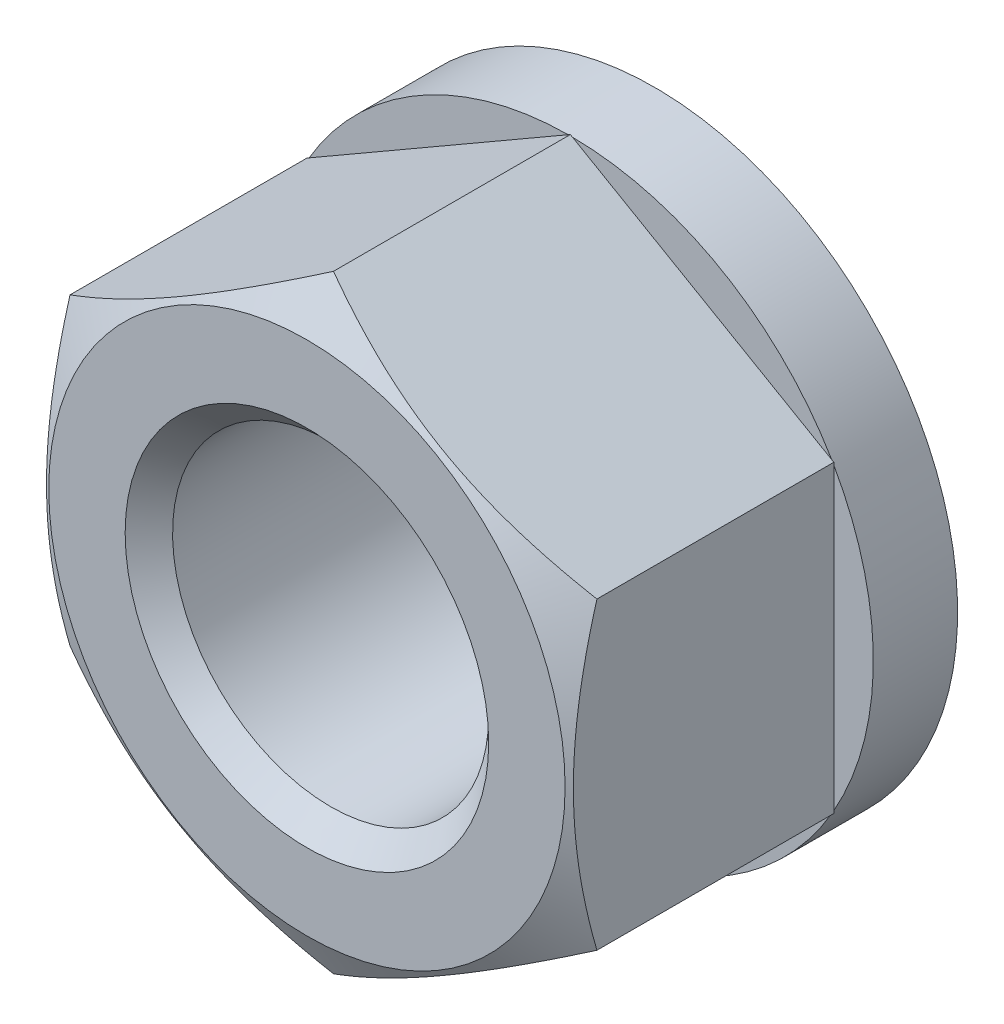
ISO-10303-21;
HEADER;
FILE_DESCRIPTION(('STEP AP214'),'2;1');
FILE_NAME('part.step','',(''),(''),'','','');
FILE_SCHEMA(('AUTOMOTIVE_DESIGN { 1 0 10303 214 1 1 1 1 }'));
ENDSEC;
DATA;
#1=APPLICATION_CONTEXT('core data for automotive mechanical design processes');
#2=APPLICATION_PROTOCOL_DEFINITION('international standard','automotive_design',2000,#1);
#3=PRODUCT_CONTEXT('',#1,'mechanical');
#4=PRODUCT('Part','Part','',(#3));
#5=PRODUCT_RELATED_PRODUCT_CATEGORY('part','',(#4));
#6=PRODUCT_DEFINITION_FORMATION('','',#4);
#7=PRODUCT_DEFINITION_CONTEXT('part definition',#1,'design');
#8=PRODUCT_DEFINITION('design','',#6,#7);
#9=PRODUCT_DEFINITION_SHAPE('','',#8);
#10=(LENGTH_UNIT() NAMED_UNIT(*) SI_UNIT(.MILLI.,.METRE.));
#11=(NAMED_UNIT(*) PLANE_ANGLE_UNIT() SI_UNIT($,.RADIAN.));
#12=(NAMED_UNIT(*) SI_UNIT($,.STERADIAN.) SOLID_ANGLE_UNIT());
#13=UNCERTAINTY_MEASURE_WITH_UNIT(LENGTH_MEASURE(1.E-05),#10,'distance_accuracy_value','');
#14=(GEOMETRIC_REPRESENTATION_CONTEXT(3) GLOBAL_UNCERTAINTY_ASSIGNED_CONTEXT((#13)) GLOBAL_UNIT_ASSIGNED_CONTEXT((#10,
#11,#12)) REPRESENTATION_CONTEXT('',''));
#15=CARTESIAN_POINT('',(0.,0.,0.));
#16=DIRECTION('',(0.,0.,1.));
#17=DIRECTION('',(1.,0.,0.));
#18=AXIS2_PLACEMENT_3D('',#15,#16,#17);
#19=CARTESIAN_POINT('',(-5.,8.66025403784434,1.6));
#20=DIRECTION('',(0.,0.,1.));
#21=DIRECTION('',(0.,1.,0.));
#22=AXIS2_PLACEMENT_3D('',#19,#20,#21);
#23=PLANE('',#22);
#24=CARTESIAN_POINT('',(0.,0.,1.6));
#25=DIRECTION('',(0.,0.,-1.));
#26=DIRECTION('',(-1.,0.,0.));
#27=AXIS2_PLACEMENT_3D('',#24,#25,#26);
#28=CIRCLE('',#27,5.75);
#29=CARTESIAN_POINT('',(-5.,2.83945417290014,1.6));
#30=VERTEX_POINT('',#29);
#31=CARTESIAN_POINT('',(-4.95903944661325,2.91039993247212,1.6));
#32=VERTEX_POINT('',#31);
#33=EDGE_CURVE('E29',#30,#32,#28,.T.);
#34=ORIENTED_EDGE('',*,*,#33,.F.);
#35=DIRECTION('',(0.,1.,0.));
#36=VECTOR('',#35,1.);
#37=CARTESIAN_POINT('',(-5.,-2.88675134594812,1.6));
#38=LINE('',#37,#36);
#39=CARTESIAN_POINT('',(-5.,2.88675134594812,1.6));
#40=VERTEX_POINT('',#39);
#41=EDGE_CURVE('E112',#30,#40,#38,.T.);
#42=ORIENTED_EDGE('',*,*,#41,.T.);
#43=DIRECTION('',(0.866025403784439,0.5,0.));
#44=VECTOR('',#43,1.);
#45=CARTESIAN_POINT('',(-5.,2.88675134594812,1.6));
#46=LINE('',#45,#44);
#47=EDGE_CURVE('E491',#40,#32,#46,.T.);
#48=ORIENTED_EDGE('',*,*,#47,.T.);
#49=EDGE_LOOP('',(#34,#42,#48));
#50=FACE_BOUND('',#49,.T.);
#51=ADVANCED_FACE('F14',(#50),#23,.F.);
#52=CARTESIAN_POINT('',(-0.0409605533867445,5.74985410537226,1.6));
#53=VERTEX_POINT('',#52);
#54=CARTESIAN_POINT('',(0.040960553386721,5.74985410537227,1.6));
#55=VERTEX_POINT('',#54);
#56=EDGE_CURVE('E142',#53,#55,#28,.T.);
#57=ORIENTED_EDGE('',*,*,#56,.F.);
#58=CARTESIAN_POINT('',(0.,5.77350269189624,1.6));
#59=VERTEX_POINT('',#58);
#60=EDGE_CURVE('E140',#53,#59,#46,.T.);
#61=ORIENTED_EDGE('',*,*,#60,.T.);
#62=DIRECTION('',(0.866025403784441,-0.5,0.));
#63=VECTOR('',#62,1.);
#64=CARTESIAN_POINT('',(0.,5.77350269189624,1.6));
#65=LINE('',#64,#63);
#66=EDGE_CURVE('E173',#59,#55,#65,.T.);
#67=ORIENTED_EDGE('',*,*,#66,.T.);
#68=EDGE_LOOP('',(#57,#61,#67));
#69=FACE_BOUND('',#68,.T.);
#70=ADVANCED_FACE('F272',(#69),#23,.F.);
#71=CARTESIAN_POINT('',(4.95903944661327,2.91039993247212,1.6));
#72=VERTEX_POINT('',#71);
#73=CARTESIAN_POINT('',(5.,2.83945417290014,1.6));
#74=VERTEX_POINT('',#73);
#75=EDGE_CURVE('E147',#72,#74,#28,.T.);
#76=ORIENTED_EDGE('',*,*,#75,.F.);
#77=CARTESIAN_POINT('',(5.,2.88675134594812,1.6));
#78=VERTEX_POINT('',#77);
#79=EDGE_CURVE('E483',#72,#78,#65,.T.);
#80=ORIENTED_EDGE('',*,*,#79,.T.);
#81=DIRECTION('',(0.,-1.,0.));
#82=VECTOR('',#81,1.);
#83=CARTESIAN_POINT('',(5.,2.88675134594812,1.6));
#84=LINE('',#83,#82);
#85=EDGE_CURVE('E175',#78,#74,#84,.T.);
#86=ORIENTED_EDGE('',*,*,#85,.T.);
#87=EDGE_LOOP('',(#76,#80,#86));
#88=FACE_BOUND('',#87,.T.);
#89=ADVANCED_FACE('F279',(#88),#23,.F.);
#90=CARTESIAN_POINT('',(5.,-2.83945417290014,1.6));
#91=VERTEX_POINT('',#90);
#92=CARTESIAN_POINT('',(4.95903944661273,-2.91039993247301,1.6));
#93=VERTEX_POINT('',#92);
#94=EDGE_CURVE('E131',#91,#93,#28,.T.);
#95=ORIENTED_EDGE('',*,*,#94,.F.);
#96=CARTESIAN_POINT('',(5.,-2.88675134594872,1.6));
#97=VERTEX_POINT('',#96);
#98=EDGE_CURVE('E160',#91,#97,#84,.T.);
#99=ORIENTED_EDGE('',*,*,#98,.T.);
#100=DIRECTION('',(-0.866025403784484,-0.499999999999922,0.));
#101=VECTOR('',#100,1.);
#102=CARTESIAN_POINT('',(5.,-2.88675134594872,1.6));
#103=LINE('',#102,#101);
#104=EDGE_CURVE('E163',#97,#93,#103,.T.);
#105=ORIENTED_EDGE('',*,*,#104,.T.);
#106=EDGE_LOOP('',(#95,#99,#105));
#107=FACE_BOUND('',#106,.T.);
#108=ADVANCED_FACE('F159',(#107),#23,.F.);
#109=CARTESIAN_POINT('',(0.0409605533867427,-5.74985410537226,1.6));
#110=VERTEX_POINT('',#109);
#111=CARTESIAN_POINT('',(-0.0409605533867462,-5.74985410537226,1.6));
#112=VERTEX_POINT('',#111);
#113=EDGE_CURVE('E129',#110,#112,#28,.T.);
#114=ORIENTED_EDGE('',*,*,#113,.F.);
#115=CARTESIAN_POINT('',(0.,-5.77350269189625,1.6));
#116=VERTEX_POINT('',#115);
#117=EDGE_CURVE('E178',#110,#116,#103,.T.);
#118=ORIENTED_EDGE('',*,*,#117,.T.);
#119=DIRECTION('',(-0.866025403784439,0.5,0.));
#120=VECTOR('',#119,1.);
#121=CARTESIAN_POINT('',(0.,-5.77350269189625,1.6));
#122=LINE('',#121,#120);
#123=EDGE_CURVE('E183',#116,#112,#122,.T.);
#124=ORIENTED_EDGE('',*,*,#123,.T.);
#125=EDGE_LOOP('',(#114,#118,#124));
#126=FACE_BOUND('',#125,.T.);
#127=ADVANCED_FACE('F293',(#126),#23,.F.);
#128=CARTESIAN_POINT('',(-4.95903944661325,-2.91039993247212,1.6));
#129=VERTEX_POINT('',#128);
#130=CARTESIAN_POINT('',(-5.,-2.83945417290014,1.6));
#131=VERTEX_POINT('',#130);
#132=EDGE_CURVE('E37',#129,#131,#28,.T.);
#133=ORIENTED_EDGE('',*,*,#132,.F.);
#134=CARTESIAN_POINT('',(-5.,-2.88675134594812,1.6));
#135=VERTEX_POINT('',#134);
#136=EDGE_CURVE('E105',#129,#135,#122,.T.);
#137=ORIENTED_EDGE('',*,*,#136,.T.);
#138=EDGE_CURVE('E102',#135,#131,#38,.T.);
#139=ORIENTED_EDGE('',*,*,#138,.T.);
#140=EDGE_LOOP('',(#133,#137,#139));
#141=FACE_BOUND('',#140,.T.);
#142=ADVANCED_FACE('F104',(#141),#23,.F.);
#143=CARTESIAN_POINT('',(-5.,-2.88675134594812,6.6));
#144=DIRECTION('',(-1.,0.,0.));
#145=DIRECTION('',(0.,0.,1.));
#146=AXIS2_PLACEMENT_3D('',#143,#144,#145);
#147=PLANE('',#146);
#148=ORIENTED_EDGE('',*,*,#138,.F.);
#149=DIRECTION('',(0.,0.,-1.));
#150=VECTOR('',#149,1.);
#151=CARTESIAN_POINT('',(-5.,-2.88675134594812,6.6));
#152=LINE('',#151,#150);
#153=CARTESIAN_POINT('',(-5.,-2.88675134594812,6.09568298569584));
#154=VERTEX_POINT('',#153);
#155=EDGE_CURVE('E130',#154,#135,#152,.T.);
#156=ORIENTED_EDGE('',*,*,#155,.F.);
#157=CARTESIAN_POINT('',(-5.,-7.69916314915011,4.12879263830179));
#158=CARTESIAN_POINT('',(-5.,-7.48123566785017,4.23428462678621));
#159=CARTESIAN_POINT('',(-5.,-7.26280196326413,4.3387490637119));
#160=CARTESIAN_POINT('',(-5.,-6.82465268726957,4.54504377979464));
#161=CARTESIAN_POINT('',(-5.,-6.60493691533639,4.64687363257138));
#162=CARTESIAN_POINT('',(-5.,-6.16279540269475,4.84784426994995));
#163=CARTESIAN_POINT('',(-5.,-5.94036138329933,4.94696690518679));
#164=CARTESIAN_POINT('',(-5.,-5.49370479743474,5.14108151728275));
#165=CARTESIAN_POINT('',(-5.,-5.26948231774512,5.23607369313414));
#166=CARTESIAN_POINT('',(-5.,-4.81186990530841,5.42371447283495));
#167=CARTESIAN_POINT('',(-5.,-4.57841191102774,5.51619801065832));
#168=CARTESIAN_POINT('',(-5.,-4.10874431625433,5.69403138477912));
#169=CARTESIAN_POINT('',(-5.,-3.87253440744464,5.77938041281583));
#170=CARTESIAN_POINT('',(-5.,-3.39744748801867,5.94066379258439));
#171=CARTESIAN_POINT('',(-5.,-3.15857718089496,6.01661768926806));
#172=CARTESIAN_POINT('',(-5.,-2.67741088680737,6.15663729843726));
#173=CARTESIAN_POINT('',(-5.,-2.43511602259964,6.22070681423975));
#174=CARTESIAN_POINT('',(-5.,-1.94829753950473,6.33350919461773));
#175=CARTESIAN_POINT('',(-5.,-1.70379306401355,6.38232313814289));
#176=CARTESIAN_POINT('',(-5.,-1.21180206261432,6.4618173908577));
#177=CARTESIAN_POINT('',(-5.,-0.964315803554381,6.49249931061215));
#178=CARTESIAN_POINT('',(-5.,-0.470806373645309,6.53287916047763));
#179=CARTESIAN_POINT('',(-5.,-0.224805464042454,6.54284247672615));
#180=CARTESIAN_POINT('',(-5.,0.267162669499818,6.54163567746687));
#181=CARTESIAN_POINT('',(-5.,0.513129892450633,6.53046503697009));
#182=CARTESIAN_POINT('',(-5.,0.932362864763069,6.49419652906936));
#183=CARTESIAN_POINT('',(-5.,1.10608264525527,6.47406050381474));
#184=CARTESIAN_POINT('',(-5.,1.45220651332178,6.42453023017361));
#185=CARTESIAN_POINT('',(-5.,1.62461041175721,6.39513467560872));
#186=CARTESIAN_POINT('',(-5.,2.13964368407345,6.29460847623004));
#187=CARTESIAN_POINT('',(-5.,2.47989285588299,6.21115802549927));
#188=CARTESIAN_POINT('',(-5.,2.98858270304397,6.06701503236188));
#189=CARTESIAN_POINT('',(-5.,3.15967426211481,6.01514963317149));
#190=CARTESIAN_POINT('',(-5.,3.50019443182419,5.90617266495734));
#191=CARTESIAN_POINT('',(-5.,3.66962303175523,5.84906106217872));
#192=CARTESIAN_POINT('',(-5.,4.00687370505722,5.7304964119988));
#193=CARTESIAN_POINT('',(-5.,4.17469631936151,5.66904488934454));
#194=CARTESIAN_POINT('',(-5.,4.50896068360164,5.54250927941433));
#195=CARTESIAN_POINT('',(-5.,4.6754024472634,5.47742522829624));
#196=CARTESIAN_POINT('',(-5.,5.05778273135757,5.32385967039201));
#197=CARTESIAN_POINT('',(-5.,5.27329135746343,5.2343099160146));
#198=CARTESIAN_POINT('',(-5.,5.70256106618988,5.05110475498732));
#199=CARTESIAN_POINT('',(-5.,5.91632205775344,4.95744913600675));
#200=CARTESIAN_POINT('',(-5.,6.34240549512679,4.7668292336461));
#201=CARTESIAN_POINT('',(-5.,6.55472767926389,4.66986436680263));
#202=CARTESIAN_POINT('',(-5.,6.9781321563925,4.47326056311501));
#203=CARTESIAN_POINT('',(-5.,7.1892144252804,4.37362157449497));
#204=CARTESIAN_POINT('',(-5.,7.82128006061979,4.07126703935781));
#205=CARTESIAN_POINT('',(-5.,8.24070087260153,3.8652867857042));
#206=CARTESIAN_POINT('',(-5.,9.07656071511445,3.44736367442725));
#207=CARTESIAN_POINT('',(-5.,9.49299964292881,3.23542061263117));
#208=CARTESIAN_POINT('',(-5.,10.099433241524,2.92283436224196));
#209=CARTESIAN_POINT('',(-5.,10.2903000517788,2.82387823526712));
#210=CARTESIAN_POINT('',(-5.,10.6716183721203,2.62517701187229));
#211=CARTESIAN_POINT('',(-5.,10.8620698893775,2.52543192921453));
#212=CARTESIAN_POINT('',(-5.,11.4328987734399,2.22516255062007));
#213=CARTESIAN_POINT('',(-5.,11.8127361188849,2.02361154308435));
#214=CARTESIAN_POINT('',(-5.,12.5704213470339,1.61887676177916));
#215=CARTESIAN_POINT('',(-5.,12.9482717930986,1.41569777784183));
#216=CARTESIAN_POINT('',(-5.,13.7030537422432,1.00768495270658));
#217=CARTESIAN_POINT('',(-5.,14.0799852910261,0.802851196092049));
#218=CARTESIAN_POINT('',(-5.,14.456575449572,0.597395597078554));
#219=B_SPLINE_CURVE_WITH_KNOTS('',3,(#157,#158,#159,#160,#161,#162,#163,#164,#165,#166,#167,
#168,#169,#170,#171,#172,#173,#174,#175,#176,#177,#178,#179,#180,#181,#182,#183,#184,#185,#186,
#187,#188,#189,#190,#191,#192,#193,#194,#195,#196,#197,#198,#199,#200,#201,#202,#203,#204,#205,
#206,#207,#208,#209,#210,#211,#212,#213,#214,#215,#216,#217,#218),.UNSPECIFIED.,.F.,.F.,(4,2,2,
2,2,2,2,2,2,2,2,2,2,2,2,2,2,2,2,2,2,2,2,2,2,2,2,2,2,2,4),(0.,0.726362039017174,1.45284090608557,
2.183368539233,2.91386093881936,3.66709851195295,4.42042130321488,5.17214959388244,
5.92363689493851,6.67105952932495,7.41841576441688,8.15613856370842,8.89387968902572,
9.41827283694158,9.94273999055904,10.9922797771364,11.5285766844,12.0648770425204,
12.600989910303,13.1370974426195,13.8371612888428,14.5372613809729,15.2374855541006,
15.9377232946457,17.339454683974,18.7412341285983,19.3862148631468,20.0311843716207,
21.3211718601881,22.6082083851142,23.8951795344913),.UNSPECIFIED.);
#220=CARTESIAN_POINT('',(-5.,2.88675134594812,6.09568298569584));
#221=VERTEX_POINT('',#220);
#222=EDGE_CURVE('E244',#154,#221,#219,.T.);
#223=ORIENTED_EDGE('',*,*,#222,.T.);
#224=DIRECTION('',(0.,0.,-1.));
#225=VECTOR('',#224,1.);
#226=CARTESIAN_POINT('',(-5.,2.88675134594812,6.6));
#227=LINE('',#226,#225);
#228=EDGE_CURVE('E497',#221,#40,#227,.T.);
#229=ORIENTED_EDGE('',*,*,#228,.T.);
#230=ORIENTED_EDGE('',*,*,#41,.F.);
#231=EDGE_CURVE('E110',#131,#30,#38,.T.);
#232=ORIENTED_EDGE('',*,*,#231,.F.);
#233=EDGE_LOOP('',(#148,#156,#223,#229,#230,#232));
#234=FACE_BOUND('',#233,.T.);
#235=ADVANCED_FACE('F115',(#234),#147,.T.);
#236=CARTESIAN_POINT('',(-5.,-2.88675134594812,6.6));
#237=DIRECTION('',(0.5,0.86602540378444,0.));
#238=DIRECTION('',(-0.86602540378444,0.5,0.));
#239=AXIS2_PLACEMENT_3D('',#236,#237,#238);
#240=PLANE('',#239);
#241=ORIENTED_EDGE('',*,*,#123,.F.);
#242=DIRECTION('',(0.,0.,-1.));
#243=VECTOR('',#242,1.);
#244=CARTESIAN_POINT('',(0.,-5.77350269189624,6.6));
#245=LINE('',#244,#243);
#246=CARTESIAN_POINT('',(0.,-5.77350269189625,6.09568298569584));
#247=VERTEX_POINT('',#246);
#248=EDGE_CURVE('E132',#247,#116,#245,.T.);
#249=ORIENTED_EDGE('',*,*,#248,.F.);
#250=CARTESIAN_POINT('',(-5.0002,-2.88663587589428,6.09561631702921));
#251=CARTESIAN_POINT('',(-4.78046540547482,-3.01349970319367,6.1688784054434));
#252=CARTESIAN_POINT('',(-4.55885141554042,-3.14144859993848,6.23551365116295));
#253=CARTESIAN_POINT('',(-4.11178600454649,-3.3995619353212,6.35182598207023));
#254=CARTESIAN_POINT('',(-3.88632664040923,-3.52973095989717,6.40146192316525));
#255=CARTESIAN_POINT('',(-3.43816769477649,-3.78847564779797,6.47871394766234));
#256=CARTESIAN_POINT('',(-3.21553790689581,-3.91701101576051,6.50684459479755));
#257=CARTESIAN_POINT('',(-2.88081009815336,-4.11026620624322,6.53207005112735));
#258=CARTESIAN_POINT('',(-2.76915780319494,-4.1747286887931,6.53765151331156));
#259=CARTESIAN_POINT('',(-2.5457500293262,-4.30371322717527,6.54306275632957));
#260=CARTESIAN_POINT('',(-2.43399455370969,-4.36823528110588,6.54289271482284));
#261=CARTESIAN_POINT('',(-2.12781576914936,-4.54500768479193,6.53451134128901));
#262=CARTESIAN_POINT('',(-1.93349391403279,-4.65719946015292,6.52043520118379));
#263=CARTESIAN_POINT('',(-1.5461398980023,-4.8808384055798,6.47579971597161));
#264=CARTESIAN_POINT('',(-1.35310909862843,-4.99228478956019,6.44522511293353));
#265=CARTESIAN_POINT('',(-0.964974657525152,-5.21637431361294,6.36879647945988));
#266=CARTESIAN_POINT('',(-0.769920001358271,-5.32898917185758,6.32261859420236));
#267=CARTESIAN_POINT('',(-0.38271965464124,-5.55253939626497,6.21781317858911));
#268=CARTESIAN_POINT('',(-0.190569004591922,-5.6634776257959,6.15921026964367));
#269=CARTESIAN_POINT('',(0.000199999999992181,-5.77361816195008,6.09561631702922));
#270=B_SPLINE_CURVE_WITH_KNOTS('',3,(#250,#251,#252,#253,#254,#255,#256,#257,#258,#259,#260,
#261,#262,#263,#264,#265,#266,#267,#268,#269),.UNSPECIFIED.,.F.,.F.,(4,2,2,2,2,2,2,2,2,4),(0.,
0.79255584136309,1.58701660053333,2.3618153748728,2.74884076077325,3.13585419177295,
3.80962362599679,4.48401723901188,5.17336882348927,5.86136694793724),.UNSPECIFIED.);
#271=EDGE_CURVE('E239',#154,#247,#270,.T.);
#272=ORIENTED_EDGE('',*,*,#271,.F.);
#273=ORIENTED_EDGE('',*,*,#155,.T.);
#274=ORIENTED_EDGE('',*,*,#136,.F.);
#275=EDGE_CURVE('E185',#112,#129,#122,.T.);
#276=ORIENTED_EDGE('',*,*,#275,.F.);
#277=EDGE_LOOP('',(#241,#249,#272,#273,#274,#276));
#278=FACE_BOUND('',#277,.T.);
#279=ADVANCED_FACE('F250',(#278),#240,.F.);
#280=CARTESIAN_POINT('',(5.,-2.88675134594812,6.6));
#281=DIRECTION('',(0.5,-0.86602540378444,0.));
#282=DIRECTION('',(0.86602540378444,0.5,0.));
#283=AXIS2_PLACEMENT_3D('',#280,#281,#282);
#284=PLANE('',#283);
#285=ORIENTED_EDGE('',*,*,#104,.F.);
#286=DIRECTION('',(0.,0.,-1.));
#287=VECTOR('',#286,1.);
#288=CARTESIAN_POINT('',(5.,-2.88675134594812,6.6));
#289=LINE('',#288,#287);
#290=CARTESIAN_POINT('',(5.,-2.88675134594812,6.09568298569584));
#291=VERTEX_POINT('',#290);
#292=EDGE_CURVE('E172',#291,#97,#289,.T.);
#293=ORIENTED_EDGE('',*,*,#292,.F.);
#294=CARTESIAN_POINT('',(5.0002,-2.88663587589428,6.09561631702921));
#295=CARTESIAN_POINT('',(4.78046540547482,-3.01349970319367,6.1688784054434));
#296=CARTESIAN_POINT('',(4.55885141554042,-3.14144859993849,6.23551365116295));
#297=CARTESIAN_POINT('',(4.11178600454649,-3.3995619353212,6.35182598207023));
#298=CARTESIAN_POINT('',(3.88632664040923,-3.52973095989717,6.40146192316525));
#299=CARTESIAN_POINT('',(3.43816769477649,-3.78847564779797,6.47871394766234));
#300=CARTESIAN_POINT('',(3.21553790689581,-3.91701101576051,6.50684459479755));
#301=CARTESIAN_POINT('',(2.88081009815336,-4.11026620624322,6.53207005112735));
#302=CARTESIAN_POINT('',(2.76915780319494,-4.1747286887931,6.53765151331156));
#303=CARTESIAN_POINT('',(2.5457500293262,-4.30371322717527,6.54306275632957));
#304=CARTESIAN_POINT('',(2.43399455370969,-4.36823528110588,6.54289271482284));
#305=CARTESIAN_POINT('',(2.12781576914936,-4.54500768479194,6.53451134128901));
#306=CARTESIAN_POINT('',(1.93349391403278,-4.65719946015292,6.52043520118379));
#307=CARTESIAN_POINT('',(1.54613989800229,-4.88083840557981,6.47579971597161));
#308=CARTESIAN_POINT('',(1.35310909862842,-4.9922847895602,6.44522511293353));
#309=CARTESIAN_POINT('',(0.964974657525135,-5.21637431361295,6.36879647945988));
#310=CARTESIAN_POINT('',(0.769920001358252,-5.32898917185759,6.32261859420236));
#311=CARTESIAN_POINT('',(0.382719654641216,-5.55253939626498,6.2178131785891));
#312=CARTESIAN_POINT('',(0.190569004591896,-5.66347762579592,6.15921026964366));
#313=CARTESIAN_POINT('',(-0.000200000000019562,-5.7736181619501,6.09561631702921));
#314=B_SPLINE_CURVE_WITH_KNOTS('',3,(#294,#295,#296,#297,#298,#299,#300,#301,#302,#303,#304,
#305,#306,#307,#308,#309,#310,#311,#312,#313),.UNSPECIFIED.,.F.,.F.,(4,2,2,2,2,2,2,2,2,4),(0.,
0.792555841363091,1.58701660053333,2.3618153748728,2.74884076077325,3.13585419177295,
3.8096236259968,4.4840172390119,5.1733688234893,5.86136694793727),.UNSPECIFIED.);
#315=EDGE_CURVE('E232',#291,#247,#314,.T.);
#316=ORIENTED_EDGE('',*,*,#315,.T.);
#317=ORIENTED_EDGE('',*,*,#248,.T.);
#318=ORIENTED_EDGE('',*,*,#117,.F.);
#319=EDGE_CURVE('E182',#93,#110,#103,.T.);
#320=ORIENTED_EDGE('',*,*,#319,.F.);
#321=EDGE_LOOP('',(#285,#293,#316,#317,#318,#320));
#322=FACE_BOUND('',#321,.T.);
#323=ADVANCED_FACE('F253',(#322),#284,.T.);
#324=CARTESIAN_POINT('',(5.,-2.88675134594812,6.6));
#325=DIRECTION('',(-1.,0.,0.));
#326=DIRECTION('',(0.,0.,1.));
#327=AXIS2_PLACEMENT_3D('',#324,#325,#326);
#328=PLANE('',#327);
#329=ORIENTED_EDGE('',*,*,#85,.F.);
#330=DIRECTION('',(0.,0.,-1.));
#331=VECTOR('',#330,1.);
#332=CARTESIAN_POINT('',(5.,2.88675134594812,6.6));
#333=LINE('',#332,#331);
#334=CARTESIAN_POINT('',(5.,2.88675134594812,6.09568298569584));
#335=VERTEX_POINT('',#334);
#336=EDGE_CURVE('E490',#335,#78,#333,.T.);
#337=ORIENTED_EDGE('',*,*,#336,.F.);
#338=CARTESIAN_POINT('',(5.,-7.69916314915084,4.12879263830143));
#339=CARTESIAN_POINT('',(5.,-7.48123566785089,4.23428462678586));
#340=CARTESIAN_POINT('',(5.,-7.26280196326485,4.33874906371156));
#341=CARTESIAN_POINT('',(5.,-6.82465268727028,4.54504377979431));
#342=CARTESIAN_POINT('',(5.,-6.60493691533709,4.64687363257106));
#343=CARTESIAN_POINT('',(5.,-6.16279540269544,4.84784426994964));
#344=CARTESIAN_POINT('',(5.,-5.94036138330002,4.94696690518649));
#345=CARTESIAN_POINT('',(5.,-5.49370479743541,5.14108151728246));
#346=CARTESIAN_POINT('',(5.,-5.26948231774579,5.23607369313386));
#347=CARTESIAN_POINT('',(5.,-4.81186990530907,5.42371447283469));
#348=CARTESIAN_POINT('',(5.,-4.57841191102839,5.51619801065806));
#349=CARTESIAN_POINT('',(5.,-4.10874431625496,5.69403138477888));
#350=CARTESIAN_POINT('',(5.,-3.87253440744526,5.77938041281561));
#351=CARTESIAN_POINT('',(5.,-3.39744748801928,5.94066379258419));
#352=CARTESIAN_POINT('',(5.,-3.15857718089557,6.01661768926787));
#353=CARTESIAN_POINT('',(5.,-2.67741088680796,6.1566372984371));
#354=CARTESIAN_POINT('',(5.,-2.43511602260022,6.22070681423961));
#355=CARTESIAN_POINT('',(5.,-1.9482975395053,6.33350919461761));
#356=CARTESIAN_POINT('',(5.,-1.70379306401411,6.38232313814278));
#357=CARTESIAN_POINT('',(5.,-1.21180206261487,6.46181739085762));
#358=CARTESIAN_POINT('',(5.,-0.964315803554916,6.49249931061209));
#359=CARTESIAN_POINT('',(5.,-0.470806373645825,6.5328791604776));
#360=CARTESIAN_POINT('',(5.,-0.224805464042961,6.54284247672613));
#361=CARTESIAN_POINT('',(5.,0.267162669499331,6.54163567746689));
#362=CARTESIAN_POINT('',(5.,0.513129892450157,6.53046503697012));
#363=CARTESIAN_POINT('',(5.,0.932362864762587,6.49419652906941));
#364=CARTESIAN_POINT('',(5.,1.10608264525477,6.4740605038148));
#365=CARTESIAN_POINT('',(5.,1.45220651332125,6.4245302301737));
#366=CARTESIAN_POINT('',(5.,1.62461041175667,6.39513467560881));
#367=CARTESIAN_POINT('',(5.,2.13964368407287,6.29460847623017));
#368=CARTESIAN_POINT('',(5.,2.47989285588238,6.21115802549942));
#369=CARTESIAN_POINT('',(5.,2.98858270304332,6.06701503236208));
#370=CARTESIAN_POINT('',(5.,3.15967426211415,6.0151496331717));
#371=CARTESIAN_POINT('',(5.,3.5001944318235,5.90617266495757));
#372=CARTESIAN_POINT('',(5.,3.66962303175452,5.84906106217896));
#373=CARTESIAN_POINT('',(5.,4.00687370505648,5.73049641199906));
#374=CARTESIAN_POINT('',(5.,4.17469631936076,5.66904488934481));
#375=CARTESIAN_POINT('',(5.,4.50896068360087,5.54250927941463));
#376=CARTESIAN_POINT('',(5.,4.67540244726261,5.47742522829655));
#377=CARTESIAN_POINT('',(5.,5.0577827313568,5.32385967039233));
#378=CARTESIAN_POINT('',(5.,5.27329135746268,5.23430991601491));
#379=CARTESIAN_POINT('',(5.,5.70256106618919,5.05110475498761));
#380=CARTESIAN_POINT('',(5.,5.91632205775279,4.95744913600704));
#381=CARTESIAN_POINT('',(5.,6.34240549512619,4.76682923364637));
#382=CARTESIAN_POINT('',(5.,6.55472767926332,4.66986436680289));
#383=CARTESIAN_POINT('',(5.,6.97813215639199,4.47326056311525));
#384=CARTESIAN_POINT('',(5.,7.18921442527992,4.3736215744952));
#385=CARTESIAN_POINT('',(5.,7.82128006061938,4.07126703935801));
#386=CARTESIAN_POINT('',(5.,8.24070087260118,3.86528678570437));
#387=CARTESIAN_POINT('',(5.,9.07656071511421,3.44736367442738));
#388=CARTESIAN_POINT('',(5.,9.49299964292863,3.23542061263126));
#389=CARTESIAN_POINT('',(5.,10.0994332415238,2.92283436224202));
#390=CARTESIAN_POINT('',(5.,10.2903000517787,2.82387823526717));
#391=CARTESIAN_POINT('',(5.,10.6716183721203,2.62517701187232));
#392=CARTESIAN_POINT('',(5.,10.8620698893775,2.52543192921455));
#393=CARTESIAN_POINT('',(5.,11.4328987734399,2.22516255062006));
#394=CARTESIAN_POINT('',(5.,11.8127361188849,2.02361154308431));
#395=CARTESIAN_POINT('',(5.,12.5704213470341,1.61887676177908));
#396=CARTESIAN_POINT('',(5.,12.9482717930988,1.41569777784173));
#397=CARTESIAN_POINT('',(5.,13.7030537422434,1.00768495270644));
#398=CARTESIAN_POINT('',(5.,14.0799852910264,0.80285119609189));
#399=CARTESIAN_POINT('',(5.,14.4565754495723,0.597395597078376));
#400=B_SPLINE_CURVE_WITH_KNOTS('',3,(#338,#339,#340,#341,#342,#343,#344,#345,#346,#347,#348,
#349,#350,#351,#352,#353,#354,#355,#356,#357,#358,#359,#360,#361,#362,#363,#364,#365,#366,#367,
#368,#369,#370,#371,#372,#373,#374,#375,#376,#377,#378,#379,#380,#381,#382,#383,#384,#385,#386,
#387,#388,#389,#390,#391,#392,#393,#394,#395,#396,#397,#398,#399),.UNSPECIFIED.,.F.,.F.,(4,2,2,
2,2,2,2,2,2,2,2,2,2,2,2,2,2,2,2,2,2,2,2,2,2,2,2,2,2,2,4),(0.,0.7263620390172,1.45284090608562,
2.18336853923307,2.91386093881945,3.66709851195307,4.42042130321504,5.17214959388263,
5.92363689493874,6.67105952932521,7.41841576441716,8.15613856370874,8.89387968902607,
9.41827283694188,9.94273999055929,10.9922797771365,11.5285766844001,12.0648770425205,
12.600989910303,13.1370974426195,13.8371612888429,14.5372613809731,15.2374855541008,
15.937723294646,17.3394546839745,18.741234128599,19.3862148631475,20.0311843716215,
21.321171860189,22.6082083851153,23.8951795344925),.UNSPECIFIED.);
#401=EDGE_CURVE('E225',#291,#335,#400,.T.);
#402=ORIENTED_EDGE('',*,*,#401,.F.);
#403=ORIENTED_EDGE('',*,*,#292,.T.);
#404=ORIENTED_EDGE('',*,*,#98,.F.);
#405=EDGE_CURVE('E168',#74,#91,#84,.T.);
#406=ORIENTED_EDGE('',*,*,#405,.F.);
#407=EDGE_LOOP('',(#329,#337,#402,#403,#404,#406));
#408=FACE_BOUND('',#407,.T.);
#409=ADVANCED_FACE('F167',(#408),#328,.F.);
#410=CARTESIAN_POINT('',(5.,2.88675134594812,6.6));
#411=DIRECTION('',(-0.5,-0.86602540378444,0.));
#412=DIRECTION('',(0.86602540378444,-0.5,0.));
#413=AXIS2_PLACEMENT_3D('',#410,#411,#412);
#414=PLANE('',#413);
#415=ORIENTED_EDGE('',*,*,#66,.F.);
#416=DIRECTION('',(0.,0.,-1.));
#417=VECTOR('',#416,1.);
#418=CARTESIAN_POINT('',(0.,5.77350269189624,6.6));
#419=LINE('',#418,#417);
#420=CARTESIAN_POINT('',(0.,5.77350269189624,6.09568298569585));
#421=VERTEX_POINT('',#420);
#422=EDGE_CURVE('E496',#421,#59,#419,.T.);
#423=ORIENTED_EDGE('',*,*,#422,.F.);
#424=CARTESIAN_POINT('',(5.0002,2.88663587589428,6.09561631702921));
#425=CARTESIAN_POINT('',(4.78046540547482,3.01349970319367,6.1688784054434));
#426=CARTESIAN_POINT('',(4.55885141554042,3.14144859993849,6.23551365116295));
#427=CARTESIAN_POINT('',(4.11178600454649,3.3995619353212,6.35182598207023));
#428=CARTESIAN_POINT('',(3.88632664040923,3.52973095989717,6.40146192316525));
#429=CARTESIAN_POINT('',(3.43816769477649,3.78847564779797,6.47871394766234));
#430=CARTESIAN_POINT('',(3.21553790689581,3.91701101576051,6.50684459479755));
#431=CARTESIAN_POINT('',(2.88081009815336,4.11026620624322,6.53207005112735));
#432=CARTESIAN_POINT('',(2.76915780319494,4.1747286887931,6.53765151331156));
#433=CARTESIAN_POINT('',(2.5457500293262,4.30371322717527,6.54306275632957));
#434=CARTESIAN_POINT('',(2.43399455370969,4.36823528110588,6.54289271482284));
#435=CARTESIAN_POINT('',(2.12781576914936,4.54500768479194,6.53451134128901));
#436=CARTESIAN_POINT('',(1.93349391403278,4.65719946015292,6.52043520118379));
#437=CARTESIAN_POINT('',(1.54613989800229,4.88083840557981,6.47579971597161));
#438=CARTESIAN_POINT('',(1.35310909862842,4.9922847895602,6.44522511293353));
#439=CARTESIAN_POINT('',(0.964974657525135,5.21637431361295,6.36879647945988));
#440=CARTESIAN_POINT('',(0.769920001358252,5.32898917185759,6.32261859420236));
#441=CARTESIAN_POINT('',(0.382719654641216,5.55253939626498,6.2178131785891));
#442=CARTESIAN_POINT('',(0.190569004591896,5.66347762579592,6.15921026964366));
#443=CARTESIAN_POINT('',(-0.000200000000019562,5.7736181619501,6.09561631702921));
#444=B_SPLINE_CURVE_WITH_KNOTS('',3,(#424,#425,#426,#427,#428,#429,#430,#431,#432,#433,#434,
#435,#436,#437,#438,#439,#440,#441,#442,#443),.UNSPECIFIED.,.F.,.F.,(4,2,2,2,2,2,2,2,2,4),(0.,
0.792555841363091,1.58701660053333,2.3618153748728,2.74884076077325,3.13585419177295,
3.8096236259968,4.4840172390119,5.1733688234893,5.86136694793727),.UNSPECIFIED.);
#445=EDGE_CURVE('E198',#335,#421,#444,.T.);
#446=ORIENTED_EDGE('',*,*,#445,.F.);
#447=ORIENTED_EDGE('',*,*,#336,.T.);
#448=ORIENTED_EDGE('',*,*,#79,.F.);
#449=EDGE_CURVE('E486',#55,#72,#65,.T.);
#450=ORIENTED_EDGE('',*,*,#449,.F.);
#451=EDGE_LOOP('',(#415,#423,#446,#447,#448,#450));
#452=FACE_BOUND('',#451,.T.);
#453=ADVANCED_FACE('F260',(#452),#414,.F.);
#454=CARTESIAN_POINT('',(-5.,2.88675134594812,6.6));
#455=DIRECTION('',(-0.5,0.86602540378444,0.));
#456=DIRECTION('',(-0.86602540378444,-0.5,0.));
#457=AXIS2_PLACEMENT_3D('',#454,#455,#456);
#458=PLANE('',#457);
#459=ORIENTED_EDGE('',*,*,#47,.F.);
#460=ORIENTED_EDGE('',*,*,#228,.F.);
#461=CARTESIAN_POINT('',(-5.0002,2.88663587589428,6.09561631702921));
#462=CARTESIAN_POINT('',(-4.78046540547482,3.01349970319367,6.1688784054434));
#463=CARTESIAN_POINT('',(-4.55885141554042,3.14144859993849,6.23551365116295));
#464=CARTESIAN_POINT('',(-4.11178600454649,3.3995619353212,6.35182598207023));
#465=CARTESIAN_POINT('',(-3.88632664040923,3.52973095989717,6.40146192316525));
#466=CARTESIAN_POINT('',(-3.43816769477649,3.78847564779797,6.47871394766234));
#467=CARTESIAN_POINT('',(-3.21553790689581,3.91701101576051,6.50684459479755));
#468=CARTESIAN_POINT('',(-2.88081009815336,4.11026620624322,6.53207005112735));
#469=CARTESIAN_POINT('',(-2.76915780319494,4.1747286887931,6.53765151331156));
#470=CARTESIAN_POINT('',(-2.5457500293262,4.30371322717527,6.54306275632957));
#471=CARTESIAN_POINT('',(-2.43399455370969,4.36823528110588,6.54289271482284));
#472=CARTESIAN_POINT('',(-2.12781576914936,4.54500768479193,6.53451134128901));
#473=CARTESIAN_POINT('',(-1.93349391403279,4.65719946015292,6.52043520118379));
#474=CARTESIAN_POINT('',(-1.5461398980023,4.8808384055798,6.47579971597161));
#475=CARTESIAN_POINT('',(-1.35310909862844,4.99228478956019,6.44522511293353));
#476=CARTESIAN_POINT('',(-0.964974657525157,5.21637431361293,6.36879647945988));
#477=CARTESIAN_POINT('',(-0.769920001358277,5.32898917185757,6.32261859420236));
#478=CARTESIAN_POINT('',(-0.382719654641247,5.55253939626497,6.21781317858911));
#479=CARTESIAN_POINT('',(-0.19056900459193,5.6634776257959,6.15921026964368));
#480=CARTESIAN_POINT('',(0.000199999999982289,5.77361816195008,6.09561631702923));
#481=B_SPLINE_CURVE_WITH_KNOTS('',3,(#461,#462,#463,#464,#465,#466,#467,#468,#469,#470,#471,
#472,#473,#474,#475,#476,#477,#478,#479,#480),.UNSPECIFIED.,.F.,.F.,(4,2,2,2,2,2,2,2,2,4),(0.,
0.79255584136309,1.58701660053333,2.3618153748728,2.74884076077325,3.13585419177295,
3.80962362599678,4.48401723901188,5.17336882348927,5.86136694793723),.UNSPECIFIED.);
#482=EDGE_CURVE('E189',#221,#421,#481,.T.);
#483=ORIENTED_EDGE('',*,*,#482,.T.);
#484=ORIENTED_EDGE('',*,*,#422,.T.);
#485=ORIENTED_EDGE('',*,*,#60,.F.);
#486=EDGE_CURVE('E512',#32,#53,#46,.T.);
#487=ORIENTED_EDGE('',*,*,#486,.F.);
#488=EDGE_LOOP('',(#459,#460,#483,#484,#485,#487));
#489=FACE_BOUND('',#488,.T.);
#490=ADVANCED_FACE('F205',(#489),#458,.T.);
#491=CARTESIAN_POINT('',(-5.,2.88675134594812,6.6));
#492=DIRECTION('',(0.,0.,1.));
#493=DIRECTION('',(1.,0.,0.));
#494=AXIS2_PLACEMENT_3D('',#491,#492,#493);
#495=PLANE('',#494);
#496=CARTESIAN_POINT('',(0.,0.,6.6));
#497=DIRECTION('',(0.,0.,1.));
#498=DIRECTION('',(1.,0.,0.));
#499=AXIS2_PLACEMENT_3D('',#496,#497,#498);
#500=CIRCLE('',#499,3.45);
#501=CARTESIAN_POINT('',(3.45,0.,6.6));
#502=VERTEX_POINT('',#501);
#503=EDGE_CURVE('E9',#502,#502,#500,.F.);
#504=ORIENTED_EDGE('',*,*,#503,.T.);
#505=EDGE_LOOP('',(#504));
#506=FACE_BOUND('',#505,.T.);
#507=CARTESIAN_POINT('',(0.,0.,6.6));
#508=DIRECTION('',(0.,0.,1.));
#509=DIRECTION('',(1.,0.,0.));
#510=AXIS2_PLACEMENT_3D('',#507,#508,#509);
#511=CIRCLE('',#510,4.9);
#512=CARTESIAN_POINT('',(4.9,0.,6.6));
#513=VERTEX_POINT('',#512);
#514=EDGE_CURVE('E109',#513,#513,#511,.T.);
#515=ORIENTED_EDGE('',*,*,#514,.T.);
#516=EDGE_LOOP('',(#515));
#517=FACE_BOUND('',#516,.T.);
#518=ADVANCED_FACE('F217',(#506,#517),#495,.T.);
#519=CARTESIAN_POINT('',(0.,0.,1.6));
#520=DIRECTION('',(0.,0.,-1.));
#521=DIRECTION('',(-1.,0.,0.));
#522=AXIS2_PLACEMENT_3D('',#519,#520,#521);
#523=CIRCLE('',#522,3.2);
#524=CARTESIAN_POINT('',(-3.2,0.,1.6));
#525=VERTEX_POINT('',#524);
#526=EDGE_CURVE('E342',#525,#525,#523,.T.);
#527=ORIENTED_EDGE('',*,*,#526,.T.);
#528=EDGE_LOOP('',(#527));
#529=FACE_BOUND('',#528,.T.);
#530=CARTESIAN_POINT('',(0.,0.,1.6));
#531=DIRECTION('',(0.,0.,-1.));
#532=DIRECTION('',(0.,-1.,0.));
#533=AXIS2_PLACEMENT_3D('',#530,#531,#532);
#534=CIRCLE('',#533,3.);
#535=CARTESIAN_POINT('',(0.,-3.,1.6));
#536=VERTEX_POINT('',#535);
#537=EDGE_CURVE('E500',#536,#536,#534,.T.);
#538=ORIENTED_EDGE('',*,*,#537,.F.);
#539=EDGE_LOOP('',(#538));
#540=FACE_BOUND('',#539,.T.);
#541=ADVANCED_FACE('F274',(#529,#540),#23,.F.);
#542=CARTESIAN_POINT('',(0.,0.,6.6));
#543=DIRECTION('',(0.,0.,-1.));
#544=DIRECTION('',(0.,-1.,0.));
#545=AXIS2_PLACEMENT_3D('',#542,#543,#544);
#546=CYLINDRICAL_SURFACE('',#545,3.);
#547=CARTESIAN_POINT('',(0.,0.,6.15));
#548=DIRECTION('',(0.,0.,1.));
#549=DIRECTION('',(1.,0.,0.));
#550=AXIS2_PLACEMENT_3D('',#547,#548,#549);
#551=CIRCLE('',#550,3.);
#552=CARTESIAN_POINT('',(3.,0.,6.15));
#553=VERTEX_POINT('',#552);
#554=EDGE_CURVE('E22',#553,#553,#551,.T.);
#555=ORIENTED_EDGE('',*,*,#554,.T.);
#556=EDGE_LOOP('',(#555));
#557=FACE_BOUND('',#556,.T.);
#558=ORIENTED_EDGE('',*,*,#537,.T.);
#559=EDGE_LOOP('',(#558));
#560=FACE_BOUND('',#559,.T.);
#561=ADVANCED_FACE('F214',(#557,#560),#546,.F.);
#562=CARTESIAN_POINT('',(0.,0.,6.6));
#563=DIRECTION('',(0.,0.,-1.));
#564=DIRECTION('',(-1.,0.,0.));
#565=AXIS2_PLACEMENT_3D('',#562,#563,#564);
#566=CONICAL_SURFACE('',#565,4.9,1.0471975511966);
#567=ORIENTED_EDGE('',*,*,#271,.T.);
#568=ORIENTED_EDGE('',*,*,#315,.F.);
#569=ORIENTED_EDGE('',*,*,#401,.T.);
#570=ORIENTED_EDGE('',*,*,#445,.T.);
#571=ORIENTED_EDGE('',*,*,#482,.F.);
#572=ORIENTED_EDGE('',*,*,#222,.F.);
#573=EDGE_LOOP('',(#567,#568,#569,#570,#571,#572));
#574=FACE_BOUND('',#573,.T.);
#575=ORIENTED_EDGE('',*,*,#514,.F.);
#576=EDGE_LOOP('',(#575));
#577=FACE_BOUND('',#576,.T.);
#578=ADVANCED_FACE('F208',(#574,#577),#566,.T.);
#579=CARTESIAN_POINT('',(0.,0.,1.6));
#580=DIRECTION('',(0.,0.,-1.));
#581=DIRECTION('',(-1.,0.,0.));
#582=AXIS2_PLACEMENT_3D('',#579,#580,#581);
#583=PLANE('',#582);
#584=EDGE_CURVE('E137',#32,#53,#28,.T.);
#585=ORIENTED_EDGE('',*,*,#584,.F.);
#586=ORIENTED_EDGE('',*,*,#486,.T.);
#587=EDGE_LOOP('',(#585,#586));
#588=FACE_BOUND('',#587,.T.);
#589=ADVANCED_FACE('F213',(#588),#583,.F.);
#590=EDGE_CURVE('E141',#55,#72,#28,.T.);
#591=ORIENTED_EDGE('',*,*,#590,.F.);
#592=ORIENTED_EDGE('',*,*,#449,.T.);
#593=EDGE_LOOP('',(#591,#592));
#594=FACE_BOUND('',#593,.T.);
#595=ADVANCED_FACE('F320',(#594),#583,.F.);
#596=EDGE_CURVE('E146',#74,#91,#28,.T.);
#597=ORIENTED_EDGE('',*,*,#596,.F.);
#598=ORIENTED_EDGE('',*,*,#405,.T.);
#599=EDGE_LOOP('',(#597,#598));
#600=FACE_BOUND('',#599,.T.);
#601=ADVANCED_FACE('F177',(#600),#583,.F.);
#602=EDGE_CURVE('E154',#93,#110,#28,.T.);
#603=ORIENTED_EDGE('',*,*,#602,.F.);
#604=ORIENTED_EDGE('',*,*,#319,.T.);
#605=EDGE_LOOP('',(#603,#604));
#606=FACE_BOUND('',#605,.T.);
#607=ADVANCED_FACE('F311',(#606),#583,.F.);
#608=EDGE_CURVE('E122',#112,#129,#28,.T.);
#609=ORIENTED_EDGE('',*,*,#608,.F.);
#610=ORIENTED_EDGE('',*,*,#275,.T.);
#611=EDGE_LOOP('',(#609,#610));
#612=FACE_BOUND('',#611,.T.);
#613=ADVANCED_FACE('F313',(#612),#583,.F.);
#614=EDGE_CURVE('E119',#131,#30,#28,.T.);
#615=ORIENTED_EDGE('',*,*,#614,.F.);
#616=ORIENTED_EDGE('',*,*,#231,.T.);
#617=EDGE_LOOP('',(#615,#616));
#618=FACE_BOUND('',#617,.T.);
#619=ADVANCED_FACE('F120',(#618),#583,.F.);
#620=CARTESIAN_POINT('',(0.,0.,0.));
#621=DIRECTION('',(0.,0.,-1.));
#622=DIRECTION('',(-1.,0.,0.));
#623=AXIS2_PLACEMENT_3D('',#620,#621,#622);
#624=PLANE('',#623);
#625=CARTESIAN_POINT('',(0.,0.,0.));
#626=DIRECTION('',(0.,0.,-1.));
#627=DIRECTION('',(-1.,0.,0.));
#628=AXIS2_PLACEMENT_3D('',#625,#626,#627);
#629=CIRCLE('',#628,5.75);
#630=CARTESIAN_POINT('',(-5.75,0.,0.));
#631=VERTEX_POINT('',#630);
#632=EDGE_CURVE('E136',#631,#631,#629,.T.);
#633=ORIENTED_EDGE('',*,*,#632,.T.);
#634=EDGE_LOOP('',(#633));
#635=FACE_BOUND('',#634,.T.);
#636=CARTESIAN_POINT('',(0.,0.,0.));
#637=DIRECTION('',(0.,0.,-1.));
#638=DIRECTION('',(-1.,0.,0.));
#639=AXIS2_PLACEMENT_3D('',#636,#637,#638);
#640=CIRCLE('',#639,3.2);
#641=CARTESIAN_POINT('',(-3.2,0.,0.));
#642=VERTEX_POINT('',#641);
#643=EDGE_CURVE('E123',#642,#642,#640,.T.);
#644=ORIENTED_EDGE('',*,*,#643,.F.);
#645=EDGE_LOOP('',(#644));
#646=FACE_BOUND('',#645,.T.);
#647=ADVANCED_FACE('F324',(#635,#646),#624,.T.);
#648=CARTESIAN_POINT('',(0.,0.,0.));
#649=DIRECTION('',(0.,0.,1.));
#650=DIRECTION('',(1.,0.,0.));
#651=AXIS2_PLACEMENT_3D('',#648,#649,#650);
#652=CYLINDRICAL_SURFACE('',#651,5.75);
#653=ORIENTED_EDGE('',*,*,#632,.F.);
#654=EDGE_LOOP('',(#653));
#655=FACE_BOUND('',#654,.T.);
#656=ORIENTED_EDGE('',*,*,#33,.T.);
#657=ORIENTED_EDGE('',*,*,#584,.T.);
#658=ORIENTED_EDGE('',*,*,#56,.T.);
#659=ORIENTED_EDGE('',*,*,#590,.T.);
#660=ORIENTED_EDGE('',*,*,#75,.T.);
#661=ORIENTED_EDGE('',*,*,#596,.T.);
#662=ORIENTED_EDGE('',*,*,#94,.T.);
#663=ORIENTED_EDGE('',*,*,#602,.T.);
#664=ORIENTED_EDGE('',*,*,#113,.T.);
#665=ORIENTED_EDGE('',*,*,#608,.T.);
#666=ORIENTED_EDGE('',*,*,#132,.T.);
#667=ORIENTED_EDGE('',*,*,#614,.T.);
#668=EDGE_LOOP('',(#656,#657,#658,#659,#660,#661,#662,#663,#664,#665,#666,#667));
#669=FACE_BOUND('',#668,.T.);
#670=ADVANCED_FACE('F126',(#655,#669),#652,.T.);
#671=CARTESIAN_POINT('',(0.,0.,0.));
#672=DIRECTION('',(0.,0.,1.));
#673=DIRECTION('',(1.,0.,0.));
#674=AXIS2_PLACEMENT_3D('',#671,#672,#673);
#675=CYLINDRICAL_SURFACE('',#674,3.2);
#676=ORIENTED_EDGE('',*,*,#643,.T.);
#677=EDGE_LOOP('',(#676));
#678=FACE_BOUND('',#677,.T.);
#679=ORIENTED_EDGE('',*,*,#526,.F.);
#680=EDGE_LOOP('',(#679));
#681=FACE_BOUND('',#680,.T.);
#682=ADVANCED_FACE('F328',(#678,#681),#675,.F.);
#683=CARTESIAN_POINT('',(0.,0.,6.15));
#684=DIRECTION('',(0.,0.,1.));
#685=DIRECTION('',(1.,0.,0.));
#686=AXIS2_PLACEMENT_3D('',#683,#684,#685);
#687=CONICAL_SURFACE('',#686,3.,0.785398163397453);
#688=ORIENTED_EDGE('',*,*,#503,.F.);
#689=EDGE_LOOP('',(#688));
#690=FACE_BOUND('',#689,.T.);
#691=ORIENTED_EDGE('',*,*,#554,.F.);
#692=EDGE_LOOP('',(#691));
#693=FACE_BOUND('',#692,.T.);
#694=ADVANCED_FACE('F16',(#690,#693),#687,.F.);
#695=CLOSED_SHELL('',(#51,#70,#89,#108,#127,#142,#235,#279,#323,#409,#453,#490,#518,#541,#561,
#578,#589,#595,#601,#607,#613,#619,#647,#670,#682,#694));
#696=MANIFOLD_SOLID_BREP('B1',#695);
#697=ADVANCED_BREP_SHAPE_REPRESENTATION('',(#18,#696),#14);
#698=SHAPE_DEFINITION_REPRESENTATION(#9,#697);
ENDSEC;
END-ISO-10303-21;
